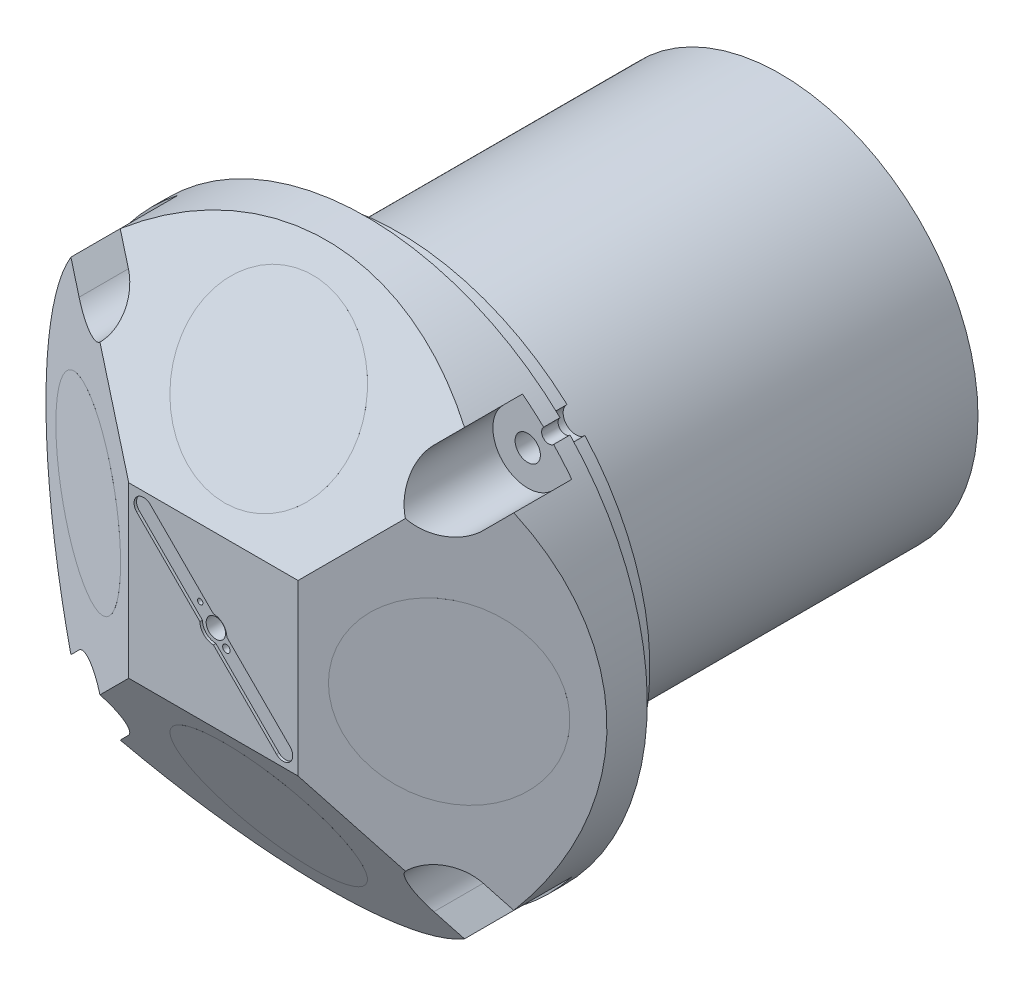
from build123d import *

# Parameters (mm, degrees)
BASE_EXTRUDE_DEPTH      = 15.24
BASE_EXTRUDE_DEPTH_BACK = 12.7
SKETCH1_R               = 79.375
SKETCH2_R               = 79.375
BOSS_EXTRUDE1_DEPTH     = 12.7
SKETCH3_R               = 79.375
BOSS_EXTRUDE2_DEPTH     = 112.76
SKETCH4_R               = 101
BOSS_EXTRUDE3_DEPTH     = 12.7
SKETCH5_R               = 112.65
BOSS_EXTRUDE4_DEPTH     = 61.6
SKETCH8_W               = 297.18
SKETCH8_H               = 195.58
CUT_EXTRUDE1_DEPTH      = 307.902915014
SKETCH9_W               = 297.18
SKETCH9_H               = 203.2
CUT_EXTRUDE2_DEPTH      = 307.902915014
SKETCH10_W              = 292.1
SKETCH10_H              = 256.54
CUT_EXTRUDE3_DEPTH      = 39.325
SKETCH11_W              = 309.88
SKETCH11_H              = 243.84
CUT_EXTRUDE5_DEPTH      = 307.902915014
SKETCH12_R              = 35.5
BOSS_EXTRUDE5_DEPTH     = 0.005
SKETCH13_R              = 35.5
BOSS_EXTRUDE8_DEPTH     = 0.005
SKETCH14_R              = 35.5
BOSS_EXTRUDE7_DEPTH     = 0.005
SKETCH15_R              = 35.5
BOSS_EXTRUDE6_DEPTH     = 0.005
CUT_EXTRUDE10_DEPTH     = 55
SKETCH17_R              = 5.08
CUT_EXTRUDE11_DEPTH     = 25
CUT_EXTRUDE12_DEPTH     = 1
SKETCH19_R              = 1.499818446
SKETCH19_R_2            = 1.081534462
CUT_EXTRUDE13_DEPTH     = 11
SKETCH20_R              = 3.899527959
CUT_EXTRUDE14_DEPTH     = 11
SKETCH24_R              = 10
CUT_EXTRUDE16_DEPTH     = 10
SKETCH26_R              = 3.302
CUT_EXTRUDE17_DEPTH     = 10
SKETCH28_R              = 2.835528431
CUT_EXTRUDE19_DEPTH     = 231.150505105


with BuildPart() as part:
    # Sketch1 → Base-Extrude (new, two sides: drawn at the far end of the back side and taken through both)
    with BuildSketch(Plane.XY.offset(-BASE_EXTRUDE_DEPTH_BACK)):
        Circle(SKETCH1_R)
    extrude(amount=BASE_EXTRUDE_DEPTH + BASE_EXTRUDE_DEPTH_BACK)

    # Sketch2 → Boss-Extrude1 (add)
    with BuildSketch(Plane.XY.offset(15.24)):
        Circle(SKETCH2_R)
    extrude(amount=BOSS_EXTRUDE1_DEPTH)

    # Sketch3 → Boss-Extrude2 (add)
    with BuildSketch(Plane.XY.offset(27.94)):
        Circle(SKETCH3_R)
    extrude(amount=BOSS_EXTRUDE2_DEPTH)

    # Sketch4 → Boss-Extrude3 (add)
    with BuildSketch(Plane.XY.offset(140.7)):
        Circle(SKETCH4_R)
    extrude(amount=BOSS_EXTRUDE3_DEPTH)

    # Sketch5 → Boss-Extrude4 (add)
    with BuildSketch(Plane.XY.offset(153.4)):
        with Locations(Location((0, 0, 0), (0, 0, 180))):
            Circle(SKETCH5_R)
    extrude(amount=BOSS_EXTRUDE4_DEPTH)

    # Sketch8 → Cut-Extrude1 (cut, through all)
    with BuildSketch(Plane(origin=(0, -101.597730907, 175.972431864), x_dir=(1, 0, 0), z_dir=(0, -0.5000000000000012, 0.8660254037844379))):
        with Locations((1.27, 34.29)):
            Rectangle(SKETCH8_W, SKETCH8_H)
    extrude(amount=CUT_EXTRUDE1_DEPTH, mode=Mode.SUBTRACT)

    # Sketch9 → Cut-Extrude2 (cut, through all)
    with BuildSketch(Plane(origin=(0, 101.597730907, 175.972431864), x_dir=(-1, 0, 0), z_dir=(0, -0.49999999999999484, -0.8660254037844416))):
        with Locations((1.27, -58.42)):
            Rectangle(SKETCH9_W, SKETCH9_H)
    extrude(amount=-CUT_EXTRUDE2_DEPTH, mode=Mode.SUBTRACT)

    # Sketch10 → Cut-Extrude3 (cut)
    with BuildSketch(Plane(origin=(-101.597730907, 0, 175.972431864), x_dir=(0.8660254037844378, 0, 0.5000000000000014), z_dir=(-0.5000000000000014, 0, 0.8660254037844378))):
        with Locations((90.17, 6.35)):
            Rectangle(SKETCH10_W, SKETCH10_H)
    extrude(amount=CUT_EXTRUDE3_DEPTH, mode=Mode.SUBTRACT)

    # Sketch11 → Cut-Extrude5 (cut, through all)
    with BuildSketch(Plane(origin=(101.597730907, 0, 175.972431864), x_dir=(-0.8660254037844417, 0, 0.4999999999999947), z_dir=(-0.4999999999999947, 0, -0.8660254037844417))):
        with Locations((20.32, -2.54)):
            Rectangle(SKETCH11_W, SKETCH11_H)
    extrude(amount=-CUT_EXTRUDE5_DEPTH, mode=Mode.SUBTRACT)

    # Sketch12 → Boss-Extrude5 (add)
    with BuildSketch(Plane(origin=(0, -101.597730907, 175.972431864), x_dir=(1, 0, 0), z_dir=(0, -0.5000000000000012, 0.8660254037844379))):
        with Locations(Location((0, 33.62, 0), (0, 0, 90))):
            Circle(SKETCH12_R)
    extrude(amount=BOSS_EXTRUDE5_DEPTH)

    # Sketch13 → Boss-Extrude8 (add)
    with BuildSketch(Plane(origin=(-101.597730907, 0, 175.972431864), x_dir=(0.8660254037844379, 0, 0.5000000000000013), z_dir=(-0.5000000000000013, 0, 0.8660254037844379))):
        with Locations((33.615136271, 0)):
            Circle(SKETCH13_R)
    extrude(amount=BOSS_EXTRUDE8_DEPTH)

    # Sketch14 → Boss-Extrude7 (add)
    with BuildSketch(Plane(origin=(101.597730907, 0, 175.972431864), x_dir=(0.8660254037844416, 0, -0.49999999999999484), z_dir=(0.49999999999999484, 0, 0.8660254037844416))):
        with Locations(Location((-33.62, 0, 0), (0, 0, 180))):
            Circle(SKETCH14_R)
    extrude(amount=BOSS_EXTRUDE7_DEPTH)

    # Sketch15 → Boss-Extrude6 (add)
    with BuildSketch(Plane(origin=(0, 101.597730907, 175.972431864), x_dir=(1, 0, 0), z_dir=(0, 0.4999999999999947, 0.8660254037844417))):
        with Locations(Location((0, -33.62, 0), (0, 0, 270))):
            Circle(SKETCH15_R)
    extrude(amount=BOSS_EXTRUDE6_DEPTH)

    # Sketch16 → Cut-Extrude10 (cut)
    with BuildSketch(Plane.XY.offset(215)):
        with BuildLine():
            Line((81.140503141, 61.341513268), (89.149070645, 69.350080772))
            ThreePointArc((89.149070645, 69.350080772), (79.865482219, 79.865482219), (69.350080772, 89.149070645))
            Line((69.350080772, 89.149070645), (61.341513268, 81.140503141))
            ThreePointArc((61.341513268, 81.140503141), (61.341513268, 61.341513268), (81.140503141, 61.341513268))
        make_face()
        with BuildLine():
            Line((-61.341513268, 81.140503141), (-69.350080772, 89.149070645))
            ThreePointArc((-69.350080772, 89.149070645), (-79.865482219, 79.865482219), (-89.149070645, 69.350080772))
            Line((-89.149070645, 69.350080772), (-81.140503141, 61.341513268))
            ThreePointArc((-81.140503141, 61.341513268), (-61.341513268, 61.341513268), (-61.341513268, 81.140503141))
        make_face()
        with BuildLine():
            Line((-81.140503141, -61.341513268), (-89.149070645, -69.350080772))
            ThreePointArc((-89.149070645, -69.350080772), (-79.865482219, -79.865482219), (-69.350080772, -89.149070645))
            Line((-69.350080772, -89.149070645), (-61.341513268, -81.140503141))
            ThreePointArc((-61.341513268, -81.140503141), (-61.341513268, -61.341513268), (-81.140503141, -61.341513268))
        make_face()
        with BuildLine():
            Line((61.341513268, -81.140503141), (69.350080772, -89.149070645))
            ThreePointArc((69.350080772, -89.149070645), (79.865482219, -79.865482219), (89.149070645, -69.350080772))
            Line((89.149070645, -69.350080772), (81.140503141, -61.341513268))
            ThreePointArc((81.140503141, -61.341513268), (61.341513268, -61.341513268), (61.341513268, -81.140503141))
        make_face()
    extrude(amount=-CUT_EXTRUDE10_DEPTH, mode=Mode.SUBTRACT)

    # Sketch17 → Cut-Extrude11 (cut)
    with BuildSketch(Plane.XY.offset(160)):
        with Locations((71.241008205, -71.241008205)):
            Circle(SKETCH17_R)
        with Locations(Location((-71.241008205, -71.241008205, 0), (0, 0, 313.62117358))):
            Circle(SKETCH17_R)
        with Locations((-71.241008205, 71.241008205)):
            Circle(SKETCH17_R)
        with Locations(Location((71.241008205, 71.241008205, 0), (0, 0, 316.37882642))):
            Circle(SKETCH17_R)
    extrude(amount=-CUT_EXTRUDE11_DEPTH, mode=Mode.SUBTRACT)

    # Sketch18 → Cut-Extrude12 (cut)
    with BuildSketch(Plane.XY.offset(215)):
        with BuildLine():
            Line((-25.346931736, 30.746278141), (0, 5.399346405))
            ThreePointArc((0, 5.399346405), (3.817914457, 3.817914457), (5.399346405, 0))
            Line((5.399346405, 0), (30.746278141, -25.346931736))
            ThreePointArc((30.746278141, -25.346931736), (30.746278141, -30.746278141), (25.346931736, -30.746278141))
            Line((25.346931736, -30.746278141), (0, -5.399346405))
            ThreePointArc((0, -5.399346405), (-3.817914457, -3.817914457), (-5.399346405, 0))
            Line((-5.399346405, 0), (-30.746278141, 25.346931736))
            ThreePointArc((-30.746278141, 25.346931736), (-30.746278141, 30.746278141), (-25.346931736, 30.746278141))
        make_face()
    extrude(amount=-CUT_EXTRUDE12_DEPTH, mode=Mode.SUBTRACT)

    # Sketch19 → Cut-Extrude13 (cut)
    with BuildSketch(Plane.XY.offset(214)):
        with Locations((4.199491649, -5.099382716)):
            Circle(SKETCH19_R)
        with Locations((-6.299237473, 5.999273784)):
            Circle(SKETCH19_R_2)
    extrude(amount=-CUT_EXTRUDE13_DEPTH, mode=Mode.SUBTRACT)

    # Sketch20 → Cut-Extrude14 (cut)
    with BuildSketch(Plane.XY.offset(214)):
        Circle(SKETCH20_R)
    extrude(amount=-CUT_EXTRUDE14_DEPTH, mode=Mode.SUBTRACT)

    # Sketch24 → Cut-Extrude16 (cut)
    with BuildSketch(Plane(origin=(0, 0, -12.7), x_dir=(-1, 0, 0), z_dir=(0, 0, -1))):
        with Locations((0, 47.778626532)):
            Circle(SKETCH24_R)
        with Locations((47.778626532, 0)):
            Circle(SKETCH24_R)
        with Locations(Location((0, -47.778626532, 0), (0, 0, 180))):
            Circle(SKETCH24_R)
        with Locations(Location((-47.778626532, 0, 0), (0, 0, 180))):
            Circle(SKETCH24_R)
    extrude(amount=-CUT_EXTRUDE16_DEPTH, mode=Mode.SUBTRACT)

    # Sketch26 → Cut-Extrude17 (cut)
    with BuildSketch(Plane(origin=(0, 0, -2.7), x_dir=(-1, 0, 0), z_dir=(0, 0, -1))):
        with Locations((47.778626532, 0)):
            Circle(SKETCH26_R)
        with Locations((0, 47.778626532)):
            Circle(SKETCH26_R)
        with Locations((-47.778626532, 0)):
            Circle(SKETCH26_R)
        with Locations((0, -47.778626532)):
            Circle(SKETCH26_R)
    extrude(amount=-CUT_EXTRUDE17_DEPTH, mode=Mode.SUBTRACT)

    # Sketch28 → Cut-Extrude19 (cut, through all)
    with BuildSketch(Plane(origin=(0, 0, 153.4), x_dir=(-1, 0, 0), z_dir=(0, 0, -1))):
        with Locations((-79.655578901, 79.655578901)):
            Circle(SKETCH28_R)
    extrude(amount=-CUT_EXTRUDE19_DEPTH, mode=Mode.SUBTRACT)


solid = part.part
